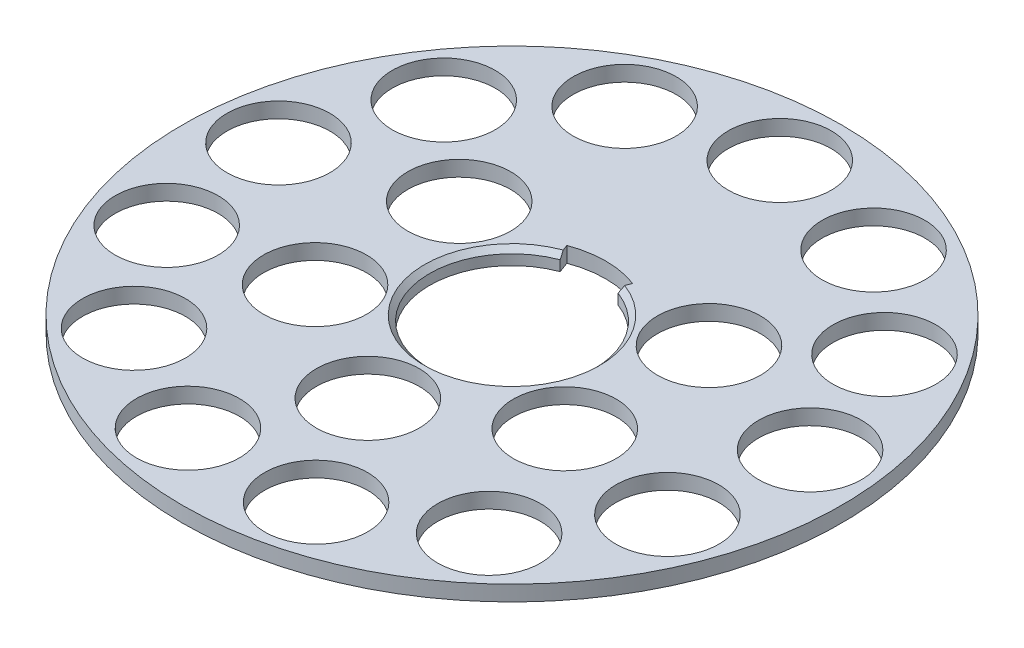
ISO-10303-21;
HEADER;
FILE_DESCRIPTION(('STEP AP214'),'2;1');
FILE_NAME('part.step','',(''),(''),'','','');
FILE_SCHEMA(('AUTOMOTIVE_DESIGN { 1 0 10303 214 1 1 1 1 }'));
ENDSEC;
DATA;
#1=APPLICATION_CONTEXT('core data for automotive mechanical design processes');
#2=APPLICATION_PROTOCOL_DEFINITION('international standard','automotive_design',2000,#1);
#3=PRODUCT_CONTEXT('',#1,'mechanical');
#4=PRODUCT('Part','Part','',(#3));
#5=PRODUCT_RELATED_PRODUCT_CATEGORY('part','',(#4));
#6=PRODUCT_DEFINITION_FORMATION('','',#4);
#7=PRODUCT_DEFINITION_CONTEXT('part definition',#1,'design');
#8=PRODUCT_DEFINITION('design','',#6,#7);
#9=PRODUCT_DEFINITION_SHAPE('','',#8);
#10=(LENGTH_UNIT() NAMED_UNIT(*) SI_UNIT(.MILLI.,.METRE.));
#11=(NAMED_UNIT(*) PLANE_ANGLE_UNIT() SI_UNIT($,.RADIAN.));
#12=(NAMED_UNIT(*) SI_UNIT($,.STERADIAN.) SOLID_ANGLE_UNIT());
#13=UNCERTAINTY_MEASURE_WITH_UNIT(LENGTH_MEASURE(1.E-05),#10,'distance_accuracy_value','');
#14=(GEOMETRIC_REPRESENTATION_CONTEXT(3) GLOBAL_UNCERTAINTY_ASSIGNED_CONTEXT((#13)) GLOBAL_UNIT_ASSIGNED_CONTEXT((#10,
#11,#12)) REPRESENTATION_CONTEXT('',''));
#15=CARTESIAN_POINT('',(0.,0.,0.));
#16=DIRECTION('',(0.,0.,1.));
#17=DIRECTION('',(1.,0.,0.));
#18=AXIS2_PLACEMENT_3D('',#15,#16,#17);
#19=CARTESIAN_POINT('',(0.,-1.5,0.));
#20=DIRECTION('',(0.,1.,0.));
#21=DIRECTION('',(0.,0.,1.));
#22=AXIS2_PLACEMENT_3D('',#19,#20,#21);
#23=CYLINDRICAL_SURFACE('',#22,32.);
#24=CARTESIAN_POINT('',(0.,-1.5,0.));
#25=DIRECTION('',(0.,1.,0.));
#26=DIRECTION('',(0.,0.,1.));
#27=AXIS2_PLACEMENT_3D('',#24,#25,#26);
#28=CIRCLE('',#27,32.);
#29=CARTESIAN_POINT('',(0.,-1.5,32.));
#30=VERTEX_POINT('',#29);
#31=EDGE_CURVE('E122',#30,#30,#28,.T.);
#32=ORIENTED_EDGE('',*,*,#31,.T.);
#33=EDGE_LOOP('',(#32));
#34=FACE_BOUND('',#33,.T.);
#35=CARTESIAN_POINT('',(0.,0.,0.));
#36=DIRECTION('',(0.,1.,0.));
#37=DIRECTION('',(0.,0.,1.));
#38=AXIS2_PLACEMENT_3D('',#35,#36,#37);
#39=CIRCLE('',#38,32.);
#40=CARTESIAN_POINT('',(0.,0.,32.));
#41=VERTEX_POINT('',#40);
#42=EDGE_CURVE('E117',#41,#41,#39,.T.);
#43=ORIENTED_EDGE('',*,*,#42,.F.);
#44=EDGE_LOOP('',(#43));
#45=FACE_BOUND('',#44,.T.);
#46=ADVANCED_FACE('F33',(#34,#45),#23,.T.);
#47=CARTESIAN_POINT('',(0.,-1.5,0.));
#48=DIRECTION('',(0.,1.,0.));
#49=DIRECTION('',(0.,0.,1.));
#50=AXIS2_PLACEMENT_3D('',#47,#48,#49);
#51=PLANE('',#50);
#52=CARTESIAN_POINT('',(-12.1243556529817,-1.5,-6.9999999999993));
#53=DIRECTION('',(0.,1.,0.));
#54=DIRECTION('',(0.,0.,1.));
#55=AXIS2_PLACEMENT_3D('',#52,#53,#54);
#56=CIRCLE('',#55,5.00000000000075);
#57=CARTESIAN_POINT('',(-12.1243556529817,-1.5,-1.99999999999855));
#58=VERTEX_POINT('',#57);
#59=EDGE_CURVE('E236',#58,#58,#56,.T.);
#60=ORIENTED_EDGE('',*,*,#59,.T.);
#61=EDGE_LOOP('',(#60));
#62=FACE_BOUND('',#61,.T.);
#63=CARTESIAN_POINT('',(-12.1243556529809,-1.5,7.00000000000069));
#64=DIRECTION('',(0.,1.,0.));
#65=DIRECTION('',(0.,0.,1.));
#66=AXIS2_PLACEMENT_3D('',#63,#64,#65);
#67=CIRCLE('',#66,5.00000000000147);
#68=CARTESIAN_POINT('',(-12.1243556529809,-1.5,12.0000000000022));
#69=VERTEX_POINT('',#68);
#70=EDGE_CURVE('E244',#69,#69,#67,.T.);
#71=ORIENTED_EDGE('',*,*,#70,.T.);
#72=EDGE_LOOP('',(#71));
#73=FACE_BOUND('',#72,.T.);
#74=CARTESIAN_POINT('',(1.58818671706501E-12,-1.5,14.));
#75=DIRECTION('',(0.,1.,0.));
#76=DIRECTION('',(0.,0.,1.));
#77=AXIS2_PLACEMENT_3D('',#74,#75,#76);
#78=CIRCLE('',#77,5.00000000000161);
#79=CARTESIAN_POINT('',(1.58818671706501E-12,-1.5,19.0000000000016));
#80=VERTEX_POINT('',#79);
#81=EDGE_CURVE('E250',#80,#80,#78,.T.);
#82=ORIENTED_EDGE('',*,*,#81,.T.);
#83=EDGE_LOOP('',(#82));
#84=FACE_BOUND('',#83,.T.);
#85=CARTESIAN_POINT('',(12.1243556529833,-1.5,6.99999999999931));
#86=DIRECTION('',(0.,1.,0.));
#87=DIRECTION('',(0.,0.,1.));
#88=AXIS2_PLACEMENT_3D('',#85,#86,#87);
#89=CIRCLE('',#88,5.000000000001);
#90=CARTESIAN_POINT('',(12.1243556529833,-1.5,12.0000000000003));
#91=VERTEX_POINT('',#90);
#92=EDGE_CURVE('E256',#91,#91,#89,.T.);
#93=ORIENTED_EDGE('',*,*,#92,.T.);
#94=EDGE_LOOP('',(#93));
#95=FACE_BOUND('',#94,.T.);
#96=CARTESIAN_POINT('',(12.1243556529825,-1.5,-7.00000000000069));
#97=DIRECTION('',(0.,1.,0.));
#98=DIRECTION('',(0.,0.,1.));
#99=AXIS2_PLACEMENT_3D('',#96,#97,#98);
#100=CIRCLE('',#99,5.00000000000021);
#101=CARTESIAN_POINT('',(12.1243556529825,-1.5,-2.00000000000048));
#102=VERTEX_POINT('',#101);
#103=EDGE_CURVE('E262',#102,#102,#100,.T.);
#104=ORIENTED_EDGE('',*,*,#103,.T.);
#105=EDGE_LOOP('',(#104));
#106=FACE_BOUND('',#105,.T.);
#107=CARTESIAN_POINT('',(-12.0828024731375,-1.5,-23.0218566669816));
#108=DIRECTION('',(0.,1.,0.));
#109=DIRECTION('',(0.,0.,1.));
#110=AXIS2_PLACEMENT_3D('',#107,#108,#109);
#111=CIRCLE('',#110,5.00000000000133);
#112=CARTESIAN_POINT('',(-12.0828024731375,-1.5,-18.0218566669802));
#113=VERTEX_POINT('',#112);
#114=EDGE_CURVE('E268',#113,#113,#111,.T.);
#115=ORIENTED_EDGE('',*,*,#114,.T.);
#116=EDGE_LOOP('',(#115));
#117=FACE_BOUND('',#116,.T.);
#118=CARTESIAN_POINT('',(-21.3975805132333,-1.5,-14.7696834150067));
#119=DIRECTION('',(0.,1.,0.));
#120=DIRECTION('',(0.,0.,1.));
#121=AXIS2_PLACEMENT_3D('',#118,#119,#120);
#122=CIRCLE('',#121,5.00000000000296);
#123=CARTESIAN_POINT('',(-21.3975805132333,-1.5,-9.76968341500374));
#124=VERTEX_POINT('',#123);
#125=EDGE_CURVE('E274',#124,#124,#122,.T.);
#126=ORIENTED_EDGE('',*,*,#125,.T.);
#127=EDGE_LOOP('',(#126));
#128=FACE_BOUND('',#127,.T.);
#129=CARTESIAN_POINT('',(-25.8104307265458,-1.5,-3.13395368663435));
#130=DIRECTION('',(0.,1.,0.));
#131=DIRECTION('',(0.,0.,1.));
#132=AXIS2_PLACEMENT_3D('',#129,#130,#131);
#133=CIRCLE('',#132,5.00000000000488);
#134=CARTESIAN_POINT('',(-25.8104307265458,-1.5,1.86604631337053));
#135=VERTEX_POINT('',#134);
#136=EDGE_CURVE('E280',#135,#135,#133,.T.);
#137=ORIENTED_EDGE('',*,*,#136,.T.);
#138=EDGE_LOOP('',(#137));
#139=FACE_BOUND('',#138,.T.);
#140=CARTESIAN_POINT('',(-24.3104223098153,-1.5,9.21972706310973));
#141=DIRECTION('',(0.,1.,0.));
#142=DIRECTION('',(0.,0.,1.));
#143=AXIS2_PLACEMENT_3D('',#140,#141,#142);
#144=CIRCLE('',#143,5.00000000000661);
#145=CARTESIAN_POINT('',(-24.3104223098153,-1.5,14.2197270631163));
#146=VERTEX_POINT('',#145);
#147=EDGE_CURVE('E286',#146,#146,#144,.T.);
#148=ORIENTED_EDGE('',*,*,#147,.T.);
#149=EDGE_LOOP('',(#148));
#150=FACE_BOUND('',#149,.T.);
#151=CARTESIAN_POINT('',(-17.2411891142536,-1.5,19.4612794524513));
#152=DIRECTION('',(0.,1.,0.));
#153=DIRECTION('',(0.,0.,1.));
#154=AXIS2_PLACEMENT_3D('',#151,#152,#153);
#155=CIRCLE('',#154,5.0000000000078);
#156=CARTESIAN_POINT('',(-17.2411891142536,-1.5,24.4612794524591));
#157=VERTEX_POINT('',#156);
#158=EDGE_CURVE('E292',#157,#157,#155,.T.);
#159=ORIENTED_EDGE('',*,*,#158,.T.);
#160=EDGE_LOOP('',(#159));
#161=FACE_BOUND('',#160,.T.);
#162=CARTESIAN_POINT('',(-6.22220727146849,-1.5,25.2444872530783));
#163=DIRECTION('',(0.,1.,0.));
#164=DIRECTION('',(0.,0.,1.));
#165=AXIS2_PLACEMENT_3D('',#162,#163,#164);
#166=CIRCLE('',#165,5.00000000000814);
#167=CARTESIAN_POINT('',(-6.22220727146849,-1.5,30.2444872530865));
#168=VERTEX_POINT('',#167);
#169=EDGE_CURVE('E298',#168,#168,#166,.T.);
#170=ORIENTED_EDGE('',*,*,#169,.T.);
#171=EDGE_LOOP('',(#170));
#172=FACE_BOUND('',#171,.T.);
#173=CARTESIAN_POINT('',(6.22220727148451,-1.5,25.2444872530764));
#174=DIRECTION('',(0.,1.,0.));
#175=DIRECTION('',(0.,0.,1.));
#176=AXIS2_PLACEMENT_3D('',#173,#174,#175);
#177=CIRCLE('',#176,5.00000000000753);
#178=CARTESIAN_POINT('',(6.22220727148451,-1.5,30.2444872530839));
#179=VERTEX_POINT('',#178);
#180=EDGE_CURVE('E304',#179,#179,#177,.T.);
#181=ORIENTED_EDGE('',*,*,#180,.T.);
#182=EDGE_LOOP('',(#181));
#183=FACE_BOUND('',#182,.T.);
#184=CARTESIAN_POINT('',(17.2411891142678,-1.5,19.4612794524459));
#185=DIRECTION('',(0.,1.,0.));
#186=DIRECTION('',(0.,0.,1.));
#187=AXIS2_PLACEMENT_3D('',#184,#185,#186);
#188=CIRCLE('',#187,5.00000000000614);
#189=CARTESIAN_POINT('',(17.2411891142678,-1.5,24.4612794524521));
#190=VERTEX_POINT('',#189);
#191=EDGE_CURVE('E310',#190,#190,#188,.T.);
#192=ORIENTED_EDGE('',*,*,#191,.T.);
#193=EDGE_LOOP('',(#192));
#194=FACE_BOUND('',#193,.T.);
#195=CARTESIAN_POINT('',(24.3104223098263,-1.5,9.21972706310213));
#196=DIRECTION('',(0.,1.,0.));
#197=DIRECTION('',(0.,0.,1.));
#198=AXIS2_PLACEMENT_3D('',#195,#196,#197);
#199=CIRCLE('',#198,5.00000000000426);
#200=CARTESIAN_POINT('',(24.3104223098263,-1.5,14.2197270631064));
#201=VERTEX_POINT('',#200);
#202=EDGE_CURVE('E316',#201,#201,#199,.T.);
#203=ORIENTED_EDGE('',*,*,#202,.T.);
#204=EDGE_LOOP('',(#203));
#205=FACE_BOUND('',#204,.T.);
#206=CARTESIAN_POINT('',(25.810430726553,-1.5,-3.13395368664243));
#207=DIRECTION('',(0.,1.,0.));
#208=DIRECTION('',(0.,0.,1.));
#209=AXIS2_PLACEMENT_3D('',#206,#207,#208);
#210=CIRCLE('',#209,5.00000000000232);
#211=CARTESIAN_POINT('',(25.810430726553,-1.5,1.86604631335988));
#212=VERTEX_POINT('',#211);
#213=EDGE_CURVE('E322',#212,#212,#210,.T.);
#214=ORIENTED_EDGE('',*,*,#213,.T.);
#215=EDGE_LOOP('',(#214));
#216=FACE_BOUND('',#215,.T.);
#217=CARTESIAN_POINT('',(21.3975805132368,-1.5,-14.7696834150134));
#218=DIRECTION('',(0.,1.,0.));
#219=DIRECTION('',(0.,0.,1.));
#220=AXIS2_PLACEMENT_3D('',#217,#218,#219);
#221=CIRCLE('',#220,5.00000000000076);
#222=CARTESIAN_POINT('',(21.3975805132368,-1.5,-9.76968341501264));
#223=VERTEX_POINT('',#222);
#224=EDGE_CURVE('E328',#223,#223,#221,.T.);
#225=ORIENTED_EDGE('',*,*,#224,.T.);
#226=EDGE_LOOP('',(#225));
#227=FACE_BOUND('',#226,.T.);
#228=CARTESIAN_POINT('',(12.0828024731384,-1.5,-23.0218566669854));
#229=DIRECTION('',(0.,1.,0.));
#230=DIRECTION('',(0.,0.,1.));
#231=AXIS2_PLACEMENT_3D('',#228,#229,#230);
#232=CIRCLE('',#231,4.99999999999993);
#233=CARTESIAN_POINT('',(12.0828024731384,-1.5,-18.0218566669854));
#234=VERTEX_POINT('',#233);
#235=EDGE_CURVE('E334',#234,#234,#232,.T.);
#236=ORIENTED_EDGE('',*,*,#235,.T.);
#237=EDGE_LOOP('',(#236));
#238=FACE_BOUND('',#237,.T.);
#239=CARTESIAN_POINT('',(0.,-1.5,-26.));
#240=DIRECTION('',(0.,1.,0.));
#241=DIRECTION('',(0.,0.,1.));
#242=AXIS2_PLACEMENT_3D('',#239,#240,#241);
#243=CIRCLE('',#242,5.);
#244=CARTESIAN_POINT('',(0.,-1.5,-21.));
#245=VERTEX_POINT('',#244);
#246=EDGE_CURVE('E113',#245,#245,#243,.T.);
#247=ORIENTED_EDGE('',*,*,#246,.T.);
#248=EDGE_LOOP('',(#247));
#249=FACE_BOUND('',#248,.T.);
#250=CARTESIAN_POINT('',(0.,-1.5,0.));
#251=DIRECTION('',(0.,1.,0.));
#252=DIRECTION('',(0.,0.,1.));
#253=AXIS2_PLACEMENT_3D('',#250,#251,#252);
#254=CIRCLE('',#253,8.);
#255=CARTESIAN_POINT('',(-2.80898753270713,-1.5,-7.49063342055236));
#256=VERTEX_POINT('',#255);
#257=CARTESIAN_POINT('',(2.80898753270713,-1.5,-7.49063342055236));
#258=VERTEX_POINT('',#257);
#259=EDGE_CURVE('E88',#256,#258,#254,.T.);
#260=ORIENTED_EDGE('',*,*,#259,.T.);
#261=DIRECTION('',(0.351123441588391,0.,-0.936329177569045));
#262=VECTOR('',#261,1.);
#263=CARTESIAN_POINT('',(3.,-1.5,-8.));
#264=LINE('',#263,#262);
#265=CARTESIAN_POINT('',(3.19522331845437,-1.5,-8.5205955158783));
#266=VERTEX_POINT('',#265);
#267=EDGE_CURVE('E81',#258,#266,#264,.T.);
#268=ORIENTED_EDGE('',*,*,#267,.T.);
#269=CARTESIAN_POINT('',(0.,-1.5,0.));
#270=DIRECTION('',(0.,1.,0.));
#271=DIRECTION('',(0.,0.,1.));
#272=AXIS2_PLACEMENT_3D('',#269,#270,#271);
#273=CIRCLE('',#272,9.1);
#274=CARTESIAN_POINT('',(-3.19522331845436,-1.5,-8.52059551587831));
#275=VERTEX_POINT('',#274);
#276=EDGE_CURVE('E92',#266,#275,#273,.T.);
#277=ORIENTED_EDGE('',*,*,#276,.T.);
#278=DIRECTION('',(0.351123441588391,0.,0.936329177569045));
#279=VECTOR('',#278,1.);
#280=CARTESIAN_POINT('',(-3.,-1.5,-8.));
#281=LINE('',#280,#279);
#282=EDGE_CURVE('E96',#275,#256,#281,.T.);
#283=ORIENTED_EDGE('',*,*,#282,.T.);
#284=EDGE_LOOP('',(#260,#268,#277,#283));
#285=FACE_BOUND('',#284,.T.);
#286=ORIENTED_EDGE('',*,*,#31,.F.);
#287=EDGE_LOOP('',(#286));
#288=FACE_BOUND('',#287,.T.);
#289=ADVANCED_FACE('F99',(#62,#73,#84,#95,#106,#117,#128,#139,#150,#161,#172,#183,#194,#205,
#216,#227,#238,#249,#285,#288),#51,.F.);
#290=CARTESIAN_POINT('',(0.,0.,0.));
#291=DIRECTION('',(0.,1.,0.));
#292=DIRECTION('',(0.,0.,1.));
#293=AXIS2_PLACEMENT_3D('',#290,#291,#292);
#294=PLANE('',#293);
#295=CARTESIAN_POINT('',(-12.1243556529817,0.,-6.9999999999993));
#296=DIRECTION('',(0.,1.,0.));
#297=DIRECTION('',(0.,0.,1.));
#298=AXIS2_PLACEMENT_3D('',#295,#296,#297);
#299=CIRCLE('',#298,5.00000000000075);
#300=CARTESIAN_POINT('',(-12.1243556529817,0.,-1.99999999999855));
#301=VERTEX_POINT('',#300);
#302=EDGE_CURVE('E239',#301,#301,#299,.T.);
#303=ORIENTED_EDGE('',*,*,#302,.F.);
#304=EDGE_LOOP('',(#303));
#305=FACE_BOUND('',#304,.T.);
#306=CARTESIAN_POINT('',(-12.1243556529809,0.,7.00000000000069));
#307=DIRECTION('',(0.,1.,0.));
#308=DIRECTION('',(0.,0.,1.));
#309=AXIS2_PLACEMENT_3D('',#306,#307,#308);
#310=CIRCLE('',#309,5.00000000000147);
#311=CARTESIAN_POINT('',(-12.1243556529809,0.,12.0000000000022));
#312=VERTEX_POINT('',#311);
#313=EDGE_CURVE('E241',#312,#312,#310,.T.);
#314=ORIENTED_EDGE('',*,*,#313,.F.);
#315=EDGE_LOOP('',(#314));
#316=FACE_BOUND('',#315,.T.);
#317=CARTESIAN_POINT('',(1.58818671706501E-12,0.,14.));
#318=DIRECTION('',(0.,1.,0.));
#319=DIRECTION('',(0.,0.,1.));
#320=AXIS2_PLACEMENT_3D('',#317,#318,#319);
#321=CIRCLE('',#320,5.00000000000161);
#322=CARTESIAN_POINT('',(1.58818671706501E-12,0.,19.0000000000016));
#323=VERTEX_POINT('',#322);
#324=EDGE_CURVE('E247',#323,#323,#321,.T.);
#325=ORIENTED_EDGE('',*,*,#324,.F.);
#326=EDGE_LOOP('',(#325));
#327=FACE_BOUND('',#326,.T.);
#328=CARTESIAN_POINT('',(12.1243556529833,0.,6.99999999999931));
#329=DIRECTION('',(0.,1.,0.));
#330=DIRECTION('',(0.,0.,1.));
#331=AXIS2_PLACEMENT_3D('',#328,#329,#330);
#332=CIRCLE('',#331,5.000000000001);
#333=CARTESIAN_POINT('',(12.1243556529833,0.,12.0000000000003));
#334=VERTEX_POINT('',#333);
#335=EDGE_CURVE('E253',#334,#334,#332,.T.);
#336=ORIENTED_EDGE('',*,*,#335,.F.);
#337=EDGE_LOOP('',(#336));
#338=FACE_BOUND('',#337,.T.);
#339=CARTESIAN_POINT('',(12.1243556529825,0.,-7.00000000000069));
#340=DIRECTION('',(0.,1.,0.));
#341=DIRECTION('',(0.,0.,1.));
#342=AXIS2_PLACEMENT_3D('',#339,#340,#341);
#343=CIRCLE('',#342,5.00000000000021);
#344=CARTESIAN_POINT('',(12.1243556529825,0.,-2.00000000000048));
#345=VERTEX_POINT('',#344);
#346=EDGE_CURVE('E259',#345,#345,#343,.T.);
#347=ORIENTED_EDGE('',*,*,#346,.F.);
#348=EDGE_LOOP('',(#347));
#349=FACE_BOUND('',#348,.T.);
#350=CARTESIAN_POINT('',(-12.0828024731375,0.,-23.0218566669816));
#351=DIRECTION('',(0.,1.,0.));
#352=DIRECTION('',(0.,0.,1.));
#353=AXIS2_PLACEMENT_3D('',#350,#351,#352);
#354=CIRCLE('',#353,5.00000000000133);
#355=CARTESIAN_POINT('',(-12.0828024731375,0.,-18.0218566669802));
#356=VERTEX_POINT('',#355);
#357=EDGE_CURVE('E265',#356,#356,#354,.T.);
#358=ORIENTED_EDGE('',*,*,#357,.F.);
#359=EDGE_LOOP('',(#358));
#360=FACE_BOUND('',#359,.T.);
#361=CARTESIAN_POINT('',(-21.3975805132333,0.,-14.7696834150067));
#362=DIRECTION('',(0.,1.,0.));
#363=DIRECTION('',(0.,0.,1.));
#364=AXIS2_PLACEMENT_3D('',#361,#362,#363);
#365=CIRCLE('',#364,5.00000000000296);
#366=CARTESIAN_POINT('',(-21.3975805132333,0.,-9.76968341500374));
#367=VERTEX_POINT('',#366);
#368=EDGE_CURVE('E271',#367,#367,#365,.T.);
#369=ORIENTED_EDGE('',*,*,#368,.F.);
#370=EDGE_LOOP('',(#369));
#371=FACE_BOUND('',#370,.T.);
#372=CARTESIAN_POINT('',(-25.8104307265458,0.,-3.13395368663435));
#373=DIRECTION('',(0.,1.,0.));
#374=DIRECTION('',(0.,0.,1.));
#375=AXIS2_PLACEMENT_3D('',#372,#373,#374);
#376=CIRCLE('',#375,5.00000000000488);
#377=CARTESIAN_POINT('',(-25.8104307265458,0.,1.86604631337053));
#378=VERTEX_POINT('',#377);
#379=EDGE_CURVE('E277',#378,#378,#376,.T.);
#380=ORIENTED_EDGE('',*,*,#379,.F.);
#381=EDGE_LOOP('',(#380));
#382=FACE_BOUND('',#381,.T.);
#383=CARTESIAN_POINT('',(-24.3104223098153,0.,9.21972706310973));
#384=DIRECTION('',(0.,1.,0.));
#385=DIRECTION('',(0.,0.,1.));
#386=AXIS2_PLACEMENT_3D('',#383,#384,#385);
#387=CIRCLE('',#386,5.00000000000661);
#388=CARTESIAN_POINT('',(-24.3104223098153,0.,14.2197270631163));
#389=VERTEX_POINT('',#388);
#390=EDGE_CURVE('E283',#389,#389,#387,.T.);
#391=ORIENTED_EDGE('',*,*,#390,.F.);
#392=EDGE_LOOP('',(#391));
#393=FACE_BOUND('',#392,.T.);
#394=CARTESIAN_POINT('',(-17.2411891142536,0.,19.4612794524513));
#395=DIRECTION('',(0.,1.,0.));
#396=DIRECTION('',(0.,0.,1.));
#397=AXIS2_PLACEMENT_3D('',#394,#395,#396);
#398=CIRCLE('',#397,5.0000000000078);
#399=CARTESIAN_POINT('',(-17.2411891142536,0.,24.4612794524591));
#400=VERTEX_POINT('',#399);
#401=EDGE_CURVE('E289',#400,#400,#398,.T.);
#402=ORIENTED_EDGE('',*,*,#401,.F.);
#403=EDGE_LOOP('',(#402));
#404=FACE_BOUND('',#403,.T.);
#405=CARTESIAN_POINT('',(-6.22220727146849,0.,25.2444872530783));
#406=DIRECTION('',(0.,1.,0.));
#407=DIRECTION('',(0.,0.,1.));
#408=AXIS2_PLACEMENT_3D('',#405,#406,#407);
#409=CIRCLE('',#408,5.00000000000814);
#410=CARTESIAN_POINT('',(-6.22220727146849,0.,30.2444872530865));
#411=VERTEX_POINT('',#410);
#412=EDGE_CURVE('E295',#411,#411,#409,.T.);
#413=ORIENTED_EDGE('',*,*,#412,.F.);
#414=EDGE_LOOP('',(#413));
#415=FACE_BOUND('',#414,.T.);
#416=CARTESIAN_POINT('',(6.22220727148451,0.,25.2444872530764));
#417=DIRECTION('',(0.,1.,0.));
#418=DIRECTION('',(0.,0.,1.));
#419=AXIS2_PLACEMENT_3D('',#416,#417,#418);
#420=CIRCLE('',#419,5.00000000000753);
#421=CARTESIAN_POINT('',(6.22220727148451,0.,30.2444872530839));
#422=VERTEX_POINT('',#421);
#423=EDGE_CURVE('E301',#422,#422,#420,.T.);
#424=ORIENTED_EDGE('',*,*,#423,.F.);
#425=EDGE_LOOP('',(#424));
#426=FACE_BOUND('',#425,.T.);
#427=CARTESIAN_POINT('',(17.2411891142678,0.,19.4612794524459));
#428=DIRECTION('',(0.,1.,0.));
#429=DIRECTION('',(0.,0.,1.));
#430=AXIS2_PLACEMENT_3D('',#427,#428,#429);
#431=CIRCLE('',#430,5.00000000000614);
#432=CARTESIAN_POINT('',(17.2411891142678,0.,24.4612794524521));
#433=VERTEX_POINT('',#432);
#434=EDGE_CURVE('E307',#433,#433,#431,.T.);
#435=ORIENTED_EDGE('',*,*,#434,.F.);
#436=EDGE_LOOP('',(#435));
#437=FACE_BOUND('',#436,.T.);
#438=CARTESIAN_POINT('',(24.3104223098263,0.,9.21972706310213));
#439=DIRECTION('',(0.,1.,0.));
#440=DIRECTION('',(0.,0.,1.));
#441=AXIS2_PLACEMENT_3D('',#438,#439,#440);
#442=CIRCLE('',#441,5.00000000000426);
#443=CARTESIAN_POINT('',(24.3104223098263,0.,14.2197270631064));
#444=VERTEX_POINT('',#443);
#445=EDGE_CURVE('E313',#444,#444,#442,.T.);
#446=ORIENTED_EDGE('',*,*,#445,.F.);
#447=EDGE_LOOP('',(#446));
#448=FACE_BOUND('',#447,.T.);
#449=CARTESIAN_POINT('',(25.810430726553,0.,-3.13395368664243));
#450=DIRECTION('',(0.,1.,0.));
#451=DIRECTION('',(0.,0.,1.));
#452=AXIS2_PLACEMENT_3D('',#449,#450,#451);
#453=CIRCLE('',#452,5.00000000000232);
#454=CARTESIAN_POINT('',(25.810430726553,0.,1.86604631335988));
#455=VERTEX_POINT('',#454);
#456=EDGE_CURVE('E319',#455,#455,#453,.T.);
#457=ORIENTED_EDGE('',*,*,#456,.F.);
#458=EDGE_LOOP('',(#457));
#459=FACE_BOUND('',#458,.T.);
#460=CARTESIAN_POINT('',(21.3975805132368,0.,-14.7696834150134));
#461=DIRECTION('',(0.,1.,0.));
#462=DIRECTION('',(0.,0.,1.));
#463=AXIS2_PLACEMENT_3D('',#460,#461,#462);
#464=CIRCLE('',#463,5.00000000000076);
#465=CARTESIAN_POINT('',(21.3975805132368,0.,-9.76968341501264));
#466=VERTEX_POINT('',#465);
#467=EDGE_CURVE('E325',#466,#466,#464,.T.);
#468=ORIENTED_EDGE('',*,*,#467,.F.);
#469=EDGE_LOOP('',(#468));
#470=FACE_BOUND('',#469,.T.);
#471=CARTESIAN_POINT('',(12.0828024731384,0.,-23.0218566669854));
#472=DIRECTION('',(0.,1.,0.));
#473=DIRECTION('',(0.,0.,1.));
#474=AXIS2_PLACEMENT_3D('',#471,#472,#473);
#475=CIRCLE('',#474,4.99999999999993);
#476=CARTESIAN_POINT('',(12.0828024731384,0.,-18.0218566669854));
#477=VERTEX_POINT('',#476);
#478=EDGE_CURVE('E331',#477,#477,#475,.T.);
#479=ORIENTED_EDGE('',*,*,#478,.F.);
#480=EDGE_LOOP('',(#479));
#481=FACE_BOUND('',#480,.T.);
#482=CARTESIAN_POINT('',(0.,0.,-26.));
#483=DIRECTION('',(0.,1.,0.));
#484=DIRECTION('',(0.,0.,1.));
#485=AXIS2_PLACEMENT_3D('',#482,#483,#484);
#486=CIRCLE('',#485,5.);
#487=CARTESIAN_POINT('',(0.,0.,-21.));
#488=VERTEX_POINT('',#487);
#489=EDGE_CURVE('E106',#488,#488,#486,.T.);
#490=ORIENTED_EDGE('',*,*,#489,.F.);
#491=EDGE_LOOP('',(#490));
#492=FACE_BOUND('',#491,.T.);
#493=DIRECTION('',(0.351123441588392,0.,-0.936329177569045));
#494=VECTOR('',#493,1.);
#495=CARTESIAN_POINT('',(2.80898753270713,0.,-7.49063342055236));
#496=LINE('',#495,#494);
#497=CARTESIAN_POINT('',(2.98454925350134,0.,-7.9587980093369));
#498=VERTEX_POINT('',#497);
#499=CARTESIAN_POINT('',(3.19522331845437,0.,-8.52059551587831));
#500=VERTEX_POINT('',#499);
#501=EDGE_CURVE('E83',#498,#500,#496,.T.);
#502=ORIENTED_EDGE('',*,*,#501,.F.);
#503=CARTESIAN_POINT('',(0.,0.,0.));
#504=DIRECTION('',(0.,1.,0.));
#505=DIRECTION('',(0.,0.,1.));
#506=AXIS2_PLACEMENT_3D('',#503,#504,#505);
#507=CIRCLE('',#506,8.50000000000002);
#508=CARTESIAN_POINT('',(-2.98454925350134,0.,-7.9587980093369));
#509=VERTEX_POINT('',#508);
#510=EDGE_CURVE('E41',#498,#509,#507,.F.);
#511=ORIENTED_EDGE('',*,*,#510,.T.);
#512=DIRECTION('',(0.351123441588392,0.,0.936329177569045));
#513=VECTOR('',#512,1.);
#514=CARTESIAN_POINT('',(-2.80898753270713,0.,-7.49063342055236));
#515=LINE('',#514,#513);
#516=CARTESIAN_POINT('',(-3.19522331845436,0.,-8.52059551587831));
#517=VERTEX_POINT('',#516);
#518=EDGE_CURVE('E103',#517,#509,#515,.T.);
#519=ORIENTED_EDGE('',*,*,#518,.F.);
#520=CARTESIAN_POINT('',(0.,0.,0.));
#521=DIRECTION('',(0.,1.,0.));
#522=DIRECTION('',(0.,0.,1.));
#523=AXIS2_PLACEMENT_3D('',#520,#521,#522);
#524=CIRCLE('',#523,9.1);
#525=EDGE_CURVE('E111',#500,#517,#524,.T.);
#526=ORIENTED_EDGE('',*,*,#525,.F.);
#527=EDGE_LOOP('',(#502,#511,#519,#526));
#528=FACE_BOUND('',#527,.T.);
#529=ORIENTED_EDGE('',*,*,#42,.T.);
#530=EDGE_LOOP('',(#529));
#531=FACE_BOUND('',#530,.T.);
#532=ADVANCED_FACE('F137',(#305,#316,#327,#338,#349,#360,#371,#382,#393,#404,#415,#426,#437,
#448,#459,#470,#481,#492,#528,#531),#294,.T.);
#533=CARTESIAN_POINT('',(2.80898753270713,-1.5,-7.49063342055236));
#534=DIRECTION('',(0.936329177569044,0.,0.351123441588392));
#535=DIRECTION('',(0.351123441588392,0.,-0.936329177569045));
#536=AXIS2_PLACEMENT_3D('',#533,#534,#535);
#537=PLANE('',#536);
#538=DIRECTION('',(0.,1.,0.));
#539=VECTOR('',#538,1.);
#540=CARTESIAN_POINT('',(2.80898753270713,-1.5,-7.49063342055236));
#541=LINE('',#540,#539);
#542=CARTESIAN_POINT('',(2.80898753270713,-0.500000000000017,-7.49063342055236));
#543=VERTEX_POINT('',#542);
#544=EDGE_CURVE('E115',#258,#543,#541,.T.);
#545=ORIENTED_EDGE('',*,*,#544,.T.);
#546=DIRECTION('',(0.24828176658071,0.707106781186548,-0.662084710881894));
#547=VECTOR('',#546,1.);
#548=CARTESIAN_POINT('',(0.,-8.50000000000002,0.));
#549=LINE('',#548,#547);
#550=EDGE_CURVE('E55',#543,#498,#549,.T.);
#551=ORIENTED_EDGE('',*,*,#550,.T.);
#552=ORIENTED_EDGE('',*,*,#501,.T.);
#553=DIRECTION('',(0.,1.,0.));
#554=VECTOR('',#553,1.);
#555=CARTESIAN_POINT('',(3.19522331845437,-1.5,-8.5205955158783));
#556=LINE('',#555,#554);
#557=EDGE_CURVE('E77',#266,#500,#556,.T.);
#558=ORIENTED_EDGE('',*,*,#557,.F.);
#559=ORIENTED_EDGE('',*,*,#267,.F.);
#560=EDGE_LOOP('',(#545,#551,#552,#558,#559));
#561=FACE_BOUND('',#560,.T.);
#562=ADVANCED_FACE('F79',(#561),#537,.F.);
#563=CARTESIAN_POINT('',(0.,-1.5,0.));
#564=DIRECTION('',(0.,1.,0.));
#565=DIRECTION('',(0.,0.,1.));
#566=AXIS2_PLACEMENT_3D('',#563,#564,#565);
#567=CYLINDRICAL_SURFACE('',#566,8.);
#568=DIRECTION('',(0.,1.,0.));
#569=VECTOR('',#568,1.);
#570=CARTESIAN_POINT('',(-2.80898753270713,-1.5,-7.49063342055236));
#571=LINE('',#570,#569);
#572=CARTESIAN_POINT('',(-2.80898753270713,-0.50000000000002,-7.49063342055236));
#573=VERTEX_POINT('',#572);
#574=EDGE_CURVE('E118',#256,#573,#571,.T.);
#575=ORIENTED_EDGE('',*,*,#574,.T.);
#576=CARTESIAN_POINT('',(0.,-0.500000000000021,0.));
#577=DIRECTION('',(0.,1.,0.));
#578=DIRECTION('',(0.,0.,1.));
#579=AXIS2_PLACEMENT_3D('',#576,#577,#578);
#580=CIRCLE('',#579,8.);
#581=EDGE_CURVE('E125',#573,#543,#580,.T.);
#582=ORIENTED_EDGE('',*,*,#581,.T.);
#583=ORIENTED_EDGE('',*,*,#544,.F.);
#584=ORIENTED_EDGE('',*,*,#259,.F.);
#585=EDGE_LOOP('',(#575,#582,#583,#584));
#586=FACE_BOUND('',#585,.T.);
#587=ADVANCED_FACE('F132',(#586),#567,.F.);
#588=CARTESIAN_POINT('',(-2.80898753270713,-1.5,-7.49063342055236));
#589=DIRECTION('',(-0.936329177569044,0.,0.351123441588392));
#590=DIRECTION('',(0.351123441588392,0.,0.936329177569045));
#591=AXIS2_PLACEMENT_3D('',#588,#589,#590);
#592=PLANE('',#591);
#593=ORIENTED_EDGE('',*,*,#518,.T.);
#594=DIRECTION('',(0.24828176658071,-0.707106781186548,0.662084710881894));
#595=VECTOR('',#594,1.);
#596=CARTESIAN_POINT('',(0.,-8.50000000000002,0.));
#597=LINE('',#596,#595);
#598=EDGE_CURVE('E11',#509,#573,#597,.T.);
#599=ORIENTED_EDGE('',*,*,#598,.T.);
#600=ORIENTED_EDGE('',*,*,#574,.F.);
#601=ORIENTED_EDGE('',*,*,#282,.F.);
#602=DIRECTION('',(0.,1.,0.));
#603=VECTOR('',#602,1.);
#604=CARTESIAN_POINT('',(-3.19522331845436,-1.5,-8.52059551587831));
#605=LINE('',#604,#603);
#606=EDGE_CURVE('E87',#275,#517,#605,.T.);
#607=ORIENTED_EDGE('',*,*,#606,.T.);
#608=EDGE_LOOP('',(#593,#599,#600,#601,#607));
#609=FACE_BOUND('',#608,.T.);
#610=ADVANCED_FACE('F136',(#609),#592,.F.);
#611=CARTESIAN_POINT('',(0.,-1.5,0.));
#612=DIRECTION('',(0.,1.,0.));
#613=DIRECTION('',(0.,0.,1.));
#614=AXIS2_PLACEMENT_3D('',#611,#612,#613);
#615=CYLINDRICAL_SURFACE('',#614,9.1);
#616=ORIENTED_EDGE('',*,*,#525,.T.);
#617=ORIENTED_EDGE('',*,*,#606,.F.);
#618=ORIENTED_EDGE('',*,*,#276,.F.);
#619=ORIENTED_EDGE('',*,*,#557,.T.);
#620=EDGE_LOOP('',(#616,#617,#618,#619));
#621=FACE_BOUND('',#620,.T.);
#622=ADVANCED_FACE('F93',(#621),#615,.F.);
#623=CARTESIAN_POINT('',(0.,-0.500000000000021,0.));
#624=DIRECTION('',(0.,1.,0.));
#625=DIRECTION('',(0.,0.,1.));
#626=AXIS2_PLACEMENT_3D('',#623,#624,#625);
#627=CONICAL_SURFACE('',#626,8.,0.785398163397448);
#628=ORIENTED_EDGE('',*,*,#598,.F.);
#629=ORIENTED_EDGE('',*,*,#510,.F.);
#630=ORIENTED_EDGE('',*,*,#550,.F.);
#631=ORIENTED_EDGE('',*,*,#581,.F.);
#632=EDGE_LOOP('',(#628,#629,#630,#631));
#633=FACE_BOUND('',#632,.T.);
#634=ADVANCED_FACE('F35',(#633),#627,.F.);
#635=CARTESIAN_POINT('',(0.,-1.5,-26.));
#636=DIRECTION('',(0.,1.,0.));
#637=DIRECTION('',(0.,0.,1.));
#638=AXIS2_PLACEMENT_3D('',#635,#636,#637);
#639=CYLINDRICAL_SURFACE('',#638,5.);
#640=ORIENTED_EDGE('',*,*,#246,.F.);
#641=EDGE_LOOP('',(#640));
#642=FACE_BOUND('',#641,.T.);
#643=ORIENTED_EDGE('',*,*,#489,.T.);
#644=EDGE_LOOP('',(#643));
#645=FACE_BOUND('',#644,.T.);
#646=ADVANCED_FACE('F160',(#642,#645),#639,.F.);
#647=CARTESIAN_POINT('',(12.0828024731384,-1.5,-23.0218566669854));
#648=DIRECTION('',(0.,1.,0.));
#649=DIRECTION('',(0.,0.,1.));
#650=AXIS2_PLACEMENT_3D('',#647,#648,#649);
#651=CYLINDRICAL_SURFACE('',#650,4.99999999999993);
#652=ORIENTED_EDGE('',*,*,#235,.F.);
#653=EDGE_LOOP('',(#652));
#654=FACE_BOUND('',#653,.T.);
#655=ORIENTED_EDGE('',*,*,#478,.T.);
#656=EDGE_LOOP('',(#655));
#657=FACE_BOUND('',#656,.T.);
#658=ADVANCED_FACE('F163',(#654,#657),#651,.F.);
#659=CARTESIAN_POINT('',(21.3975805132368,-1.5,-14.7696834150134));
#660=DIRECTION('',(0.,1.,0.));
#661=DIRECTION('',(0.,0.,1.));
#662=AXIS2_PLACEMENT_3D('',#659,#660,#661);
#663=CYLINDRICAL_SURFACE('',#662,5.00000000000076);
#664=ORIENTED_EDGE('',*,*,#224,.F.);
#665=EDGE_LOOP('',(#664));
#666=FACE_BOUND('',#665,.T.);
#667=ORIENTED_EDGE('',*,*,#467,.T.);
#668=EDGE_LOOP('',(#667));
#669=FACE_BOUND('',#668,.T.);
#670=ADVANCED_FACE('F167',(#666,#669),#663,.F.);
#671=CARTESIAN_POINT('',(25.810430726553,-1.5,-3.13395368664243));
#672=DIRECTION('',(0.,1.,0.));
#673=DIRECTION('',(0.,0.,1.));
#674=AXIS2_PLACEMENT_3D('',#671,#672,#673);
#675=CYLINDRICAL_SURFACE('',#674,5.00000000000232);
#676=ORIENTED_EDGE('',*,*,#213,.F.);
#677=EDGE_LOOP('',(#676));
#678=FACE_BOUND('',#677,.T.);
#679=ORIENTED_EDGE('',*,*,#456,.T.);
#680=EDGE_LOOP('',(#679));
#681=FACE_BOUND('',#680,.T.);
#682=ADVANCED_FACE('F171',(#678,#681),#675,.F.);
#683=CARTESIAN_POINT('',(24.3104223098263,-1.5,9.21972706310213));
#684=DIRECTION('',(0.,1.,0.));
#685=DIRECTION('',(0.,0.,1.));
#686=AXIS2_PLACEMENT_3D('',#683,#684,#685);
#687=CYLINDRICAL_SURFACE('',#686,5.00000000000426);
#688=ORIENTED_EDGE('',*,*,#202,.F.);
#689=EDGE_LOOP('',(#688));
#690=FACE_BOUND('',#689,.T.);
#691=ORIENTED_EDGE('',*,*,#445,.T.);
#692=EDGE_LOOP('',(#691));
#693=FACE_BOUND('',#692,.T.);
#694=ADVANCED_FACE('F175',(#690,#693),#687,.F.);
#695=CARTESIAN_POINT('',(17.2411891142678,-1.5,19.4612794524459));
#696=DIRECTION('',(0.,1.,0.));
#697=DIRECTION('',(0.,0.,1.));
#698=AXIS2_PLACEMENT_3D('',#695,#696,#697);
#699=CYLINDRICAL_SURFACE('',#698,5.00000000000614);
#700=ORIENTED_EDGE('',*,*,#191,.F.);
#701=EDGE_LOOP('',(#700));
#702=FACE_BOUND('',#701,.T.);
#703=ORIENTED_EDGE('',*,*,#434,.T.);
#704=EDGE_LOOP('',(#703));
#705=FACE_BOUND('',#704,.T.);
#706=ADVANCED_FACE('F179',(#702,#705),#699,.F.);
#707=CARTESIAN_POINT('',(6.22220727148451,-1.5,25.2444872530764));
#708=DIRECTION('',(0.,1.,0.));
#709=DIRECTION('',(0.,0.,1.));
#710=AXIS2_PLACEMENT_3D('',#707,#708,#709);
#711=CYLINDRICAL_SURFACE('',#710,5.00000000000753);
#712=ORIENTED_EDGE('',*,*,#180,.F.);
#713=EDGE_LOOP('',(#712));
#714=FACE_BOUND('',#713,.T.);
#715=ORIENTED_EDGE('',*,*,#423,.T.);
#716=EDGE_LOOP('',(#715));
#717=FACE_BOUND('',#716,.T.);
#718=ADVANCED_FACE('F183',(#714,#717),#711,.F.);
#719=CARTESIAN_POINT('',(-6.22220727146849,-1.5,25.2444872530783));
#720=DIRECTION('',(0.,1.,0.));
#721=DIRECTION('',(0.,0.,1.));
#722=AXIS2_PLACEMENT_3D('',#719,#720,#721);
#723=CYLINDRICAL_SURFACE('',#722,5.00000000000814);
#724=ORIENTED_EDGE('',*,*,#169,.F.);
#725=EDGE_LOOP('',(#724));
#726=FACE_BOUND('',#725,.T.);
#727=ORIENTED_EDGE('',*,*,#412,.T.);
#728=EDGE_LOOP('',(#727));
#729=FACE_BOUND('',#728,.T.);
#730=ADVANCED_FACE('F187',(#726,#729),#723,.F.);
#731=CARTESIAN_POINT('',(-17.2411891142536,-1.5,19.4612794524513));
#732=DIRECTION('',(0.,1.,0.));
#733=DIRECTION('',(0.,0.,1.));
#734=AXIS2_PLACEMENT_3D('',#731,#732,#733);
#735=CYLINDRICAL_SURFACE('',#734,5.0000000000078);
#736=ORIENTED_EDGE('',*,*,#158,.F.);
#737=EDGE_LOOP('',(#736));
#738=FACE_BOUND('',#737,.T.);
#739=ORIENTED_EDGE('',*,*,#401,.T.);
#740=EDGE_LOOP('',(#739));
#741=FACE_BOUND('',#740,.T.);
#742=ADVANCED_FACE('F191',(#738,#741),#735,.F.);
#743=CARTESIAN_POINT('',(-24.3104223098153,-1.5,9.21972706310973));
#744=DIRECTION('',(0.,1.,0.));
#745=DIRECTION('',(0.,0.,1.));
#746=AXIS2_PLACEMENT_3D('',#743,#744,#745);
#747=CYLINDRICAL_SURFACE('',#746,5.00000000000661);
#748=ORIENTED_EDGE('',*,*,#147,.F.);
#749=EDGE_LOOP('',(#748));
#750=FACE_BOUND('',#749,.T.);
#751=ORIENTED_EDGE('',*,*,#390,.T.);
#752=EDGE_LOOP('',(#751));
#753=FACE_BOUND('',#752,.T.);
#754=ADVANCED_FACE('F195',(#750,#753),#747,.F.);
#755=CARTESIAN_POINT('',(-25.8104307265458,-1.5,-3.13395368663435));
#756=DIRECTION('',(0.,1.,0.));
#757=DIRECTION('',(0.,0.,1.));
#758=AXIS2_PLACEMENT_3D('',#755,#756,#757);
#759=CYLINDRICAL_SURFACE('',#758,5.00000000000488);
#760=ORIENTED_EDGE('',*,*,#136,.F.);
#761=EDGE_LOOP('',(#760));
#762=FACE_BOUND('',#761,.T.);
#763=ORIENTED_EDGE('',*,*,#379,.T.);
#764=EDGE_LOOP('',(#763));
#765=FACE_BOUND('',#764,.T.);
#766=ADVANCED_FACE('F199',(#762,#765),#759,.F.);
#767=CARTESIAN_POINT('',(-21.3975805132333,-1.5,-14.7696834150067));
#768=DIRECTION('',(0.,1.,0.));
#769=DIRECTION('',(0.,0.,1.));
#770=AXIS2_PLACEMENT_3D('',#767,#768,#769);
#771=CYLINDRICAL_SURFACE('',#770,5.00000000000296);
#772=ORIENTED_EDGE('',*,*,#125,.F.);
#773=EDGE_LOOP('',(#772));
#774=FACE_BOUND('',#773,.T.);
#775=ORIENTED_EDGE('',*,*,#368,.T.);
#776=EDGE_LOOP('',(#775));
#777=FACE_BOUND('',#776,.T.);
#778=ADVANCED_FACE('F203',(#774,#777),#771,.F.);
#779=CARTESIAN_POINT('',(-12.0828024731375,-1.5,-23.0218566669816));
#780=DIRECTION('',(0.,1.,0.));
#781=DIRECTION('',(0.,0.,1.));
#782=AXIS2_PLACEMENT_3D('',#779,#780,#781);
#783=CYLINDRICAL_SURFACE('',#782,5.00000000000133);
#784=ORIENTED_EDGE('',*,*,#114,.F.);
#785=EDGE_LOOP('',(#784));
#786=FACE_BOUND('',#785,.T.);
#787=ORIENTED_EDGE('',*,*,#357,.T.);
#788=EDGE_LOOP('',(#787));
#789=FACE_BOUND('',#788,.T.);
#790=ADVANCED_FACE('F207',(#786,#789),#783,.F.);
#791=CARTESIAN_POINT('',(12.1243556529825,-1.5,-7.00000000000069));
#792=DIRECTION('',(0.,1.,0.));
#793=DIRECTION('',(0.,0.,1.));
#794=AXIS2_PLACEMENT_3D('',#791,#792,#793);
#795=CYLINDRICAL_SURFACE('',#794,5.00000000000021);
#796=ORIENTED_EDGE('',*,*,#103,.F.);
#797=EDGE_LOOP('',(#796));
#798=FACE_BOUND('',#797,.T.);
#799=ORIENTED_EDGE('',*,*,#346,.T.);
#800=EDGE_LOOP('',(#799));
#801=FACE_BOUND('',#800,.T.);
#802=ADVANCED_FACE('F211',(#798,#801),#795,.F.);
#803=CARTESIAN_POINT('',(12.1243556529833,-1.5,6.99999999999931));
#804=DIRECTION('',(0.,1.,0.));
#805=DIRECTION('',(0.,0.,1.));
#806=AXIS2_PLACEMENT_3D('',#803,#804,#805);
#807=CYLINDRICAL_SURFACE('',#806,5.000000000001);
#808=ORIENTED_EDGE('',*,*,#92,.F.);
#809=EDGE_LOOP('',(#808));
#810=FACE_BOUND('',#809,.T.);
#811=ORIENTED_EDGE('',*,*,#335,.T.);
#812=EDGE_LOOP('',(#811));
#813=FACE_BOUND('',#812,.T.);
#814=ADVANCED_FACE('F215',(#810,#813),#807,.F.);
#815=CARTESIAN_POINT('',(1.58818671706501E-12,-1.5,14.));
#816=DIRECTION('',(0.,1.,0.));
#817=DIRECTION('',(0.,0.,1.));
#818=AXIS2_PLACEMENT_3D('',#815,#816,#817);
#819=CYLINDRICAL_SURFACE('',#818,5.00000000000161);
#820=ORIENTED_EDGE('',*,*,#81,.F.);
#821=EDGE_LOOP('',(#820));
#822=FACE_BOUND('',#821,.T.);
#823=ORIENTED_EDGE('',*,*,#324,.T.);
#824=EDGE_LOOP('',(#823));
#825=FACE_BOUND('',#824,.T.);
#826=ADVANCED_FACE('F219',(#822,#825),#819,.F.);
#827=CARTESIAN_POINT('',(-12.1243556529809,-1.5,7.00000000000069));
#828=DIRECTION('',(0.,1.,0.));
#829=DIRECTION('',(0.,0.,1.));
#830=AXIS2_PLACEMENT_3D('',#827,#828,#829);
#831=CYLINDRICAL_SURFACE('',#830,5.00000000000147);
#832=ORIENTED_EDGE('',*,*,#70,.F.);
#833=EDGE_LOOP('',(#832));
#834=FACE_BOUND('',#833,.T.);
#835=ORIENTED_EDGE('',*,*,#313,.T.);
#836=EDGE_LOOP('',(#835));
#837=FACE_BOUND('',#836,.T.);
#838=ADVANCED_FACE('F223',(#834,#837),#831,.F.);
#839=CARTESIAN_POINT('',(-12.1243556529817,-1.5,-6.9999999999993));
#840=DIRECTION('',(0.,1.,0.));
#841=DIRECTION('',(0.,0.,1.));
#842=AXIS2_PLACEMENT_3D('',#839,#840,#841);
#843=CYLINDRICAL_SURFACE('',#842,5.00000000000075);
#844=ORIENTED_EDGE('',*,*,#59,.F.);
#845=EDGE_LOOP('',(#844));
#846=FACE_BOUND('',#845,.T.);
#847=ORIENTED_EDGE('',*,*,#302,.T.);
#848=EDGE_LOOP('',(#847));
#849=FACE_BOUND('',#848,.T.);
#850=ADVANCED_FACE('F227',(#846,#849),#843,.F.);
#851=CLOSED_SHELL('',(#46,#289,#532,#562,#587,#610,#622,#634,#646,#658,#670,#682,#694,#706,#718,
#730,#742,#754,#766,#778,#790,#802,#814,#826,#838,#850));
#852=MANIFOLD_SOLID_BREP('B2',#851);
#853=ADVANCED_BREP_SHAPE_REPRESENTATION('',(#18,#852),#14);
#854=SHAPE_DEFINITION_REPRESENTATION(#9,#853);
ENDSEC;
END-ISO-10303-21;
